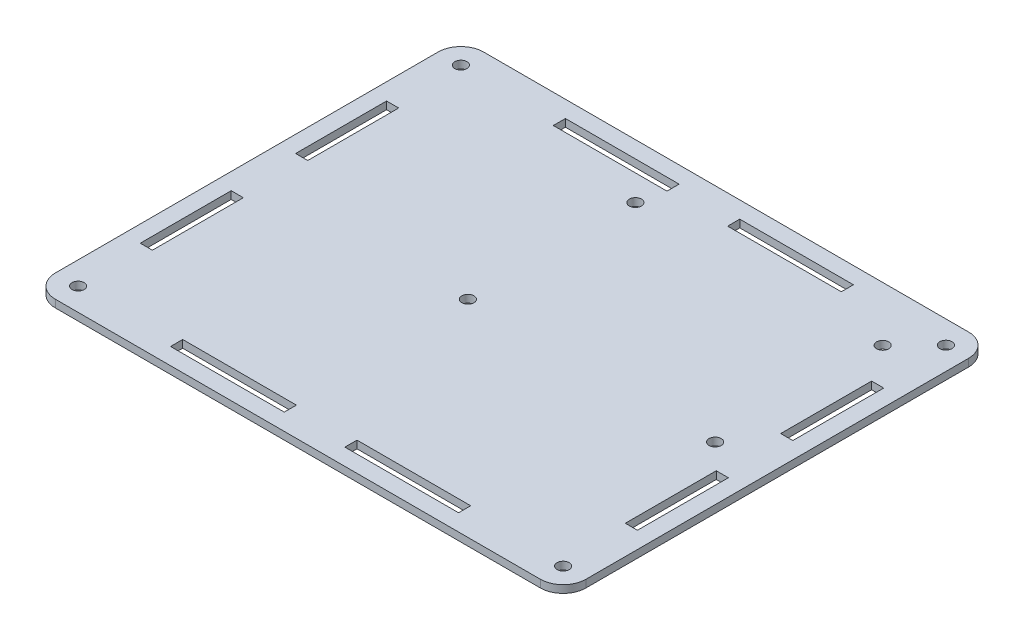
from build123d import *

# Parameters (mm, degrees)
SKETCH1_W           = 140
SKETCH1_H           = 113
SKETCH1_R           = 1.6
SKETCH1_W_2         = 3.2
SKETCH1_H_2         = 24
SKETCH1_W_3         = 30
SKETCH1_H_3         = 3.2
BOSS_EXTRUDE1_DEPTH = 2
FILLET1_R           = 6
FILLET2_R           = 6
FILLET3_R           = 6


with BuildPart() as part:
    # Sketch1 → Boss-Extrude1 (new body)
    with BuildSketch(Plane(origin=(0, 0, 0), x_dir=(1, 0, 0), z_dir=(0, 1, 0))):
        with Locations((70, 56.5)):
            Rectangle(SKETCH1_W, SKETCH1_H)
        with Locations(Location((60.437, 98.62, 0), (0, 0, 270))):
            Circle(SKETCH1_R, mode=Mode.SUBTRACT)
        with Locations(Location((125.69, 98.62, 0), (0, 0, 270))):
            Circle(SKETCH1_R, mode=Mode.SUBTRACT)
        with Locations(Location((125.69, 54.418, 0), (0, 0, 270))):
            Circle(SKETCH1_R, mode=Mode.SUBTRACT)
        with Locations(Location((60.437, 54.418, 0), (0, 0, 270))):
            Circle(SKETCH1_R, mode=Mode.SUBTRACT)
        with Locations(Location((6, 107, 0), (0, 0, 270))):
            Circle(SKETCH1_R, mode=Mode.SUBTRACT)
        with Locations(Location((134, 107, 0), (0, 0, 270))):
            Circle(SKETCH1_R, mode=Mode.SUBTRACT)
        with Locations(Location((134, 6, 0), (0, 0, 270))):
            Circle(SKETCH1_R, mode=Mode.SUBTRACT)
        with Locations(Location((6, 6, 0), (0, 0, 270))):
            Circle(SKETCH1_R, mode=Mode.SUBTRACT)
        with Locations((134, 36)):
            Rectangle(SKETCH1_W_2, SKETCH1_H_2, mode=Mode.SUBTRACT)
        with Locations((47, 6)):
            Rectangle(SKETCH1_W_3, SKETCH1_H_3, mode=Mode.SUBTRACT)
        with Locations((47, 107)):
            Rectangle(SKETCH1_W_3, SKETCH1_H_3, mode=Mode.SUBTRACT)
        with Locations((93, 6)):
            Rectangle(SKETCH1_W_3, SKETCH1_H_3, mode=Mode.SUBTRACT)
        with Locations((6, 77)):
            Rectangle(SKETCH1_W_2, SKETCH1_H_2, mode=Mode.SUBTRACT)
        with Locations((6, 36)):
            Rectangle(SKETCH1_W_2, SKETCH1_H_2, mode=Mode.SUBTRACT)
        with Locations((93, 107)):
            Rectangle(SKETCH1_W_3, SKETCH1_H_3, mode=Mode.SUBTRACT)
        with Locations((134, 77)):
            Rectangle(SKETCH1_W_2, SKETCH1_H_2, mode=Mode.SUBTRACT)
    extrude(amount=BOSS_EXTRUDE1_DEPTH)

    # Fillet1
    fillet1_edges = [part.edges().sort_by_distance(p)[0] for p in [
        (0, 1, -113),
    ]]
    fillet(fillet1_edges, radius=FILLET1_R)

    # Fillet2
    fillet2_edges = [part.edges().sort_by_distance(p)[0] for p in [
        (0, 1, 0),
    ]]
    fillet(fillet2_edges, radius=FILLET2_R)

    # Fillet3
    fillet3_edges = [part.edges().sort_by_distance(p)[0] for p in [
        (140, 1, -113),
        (140, 1, 0),
    ]]
    fillet(fillet3_edges, radius=FILLET3_R)


solid = part.part
